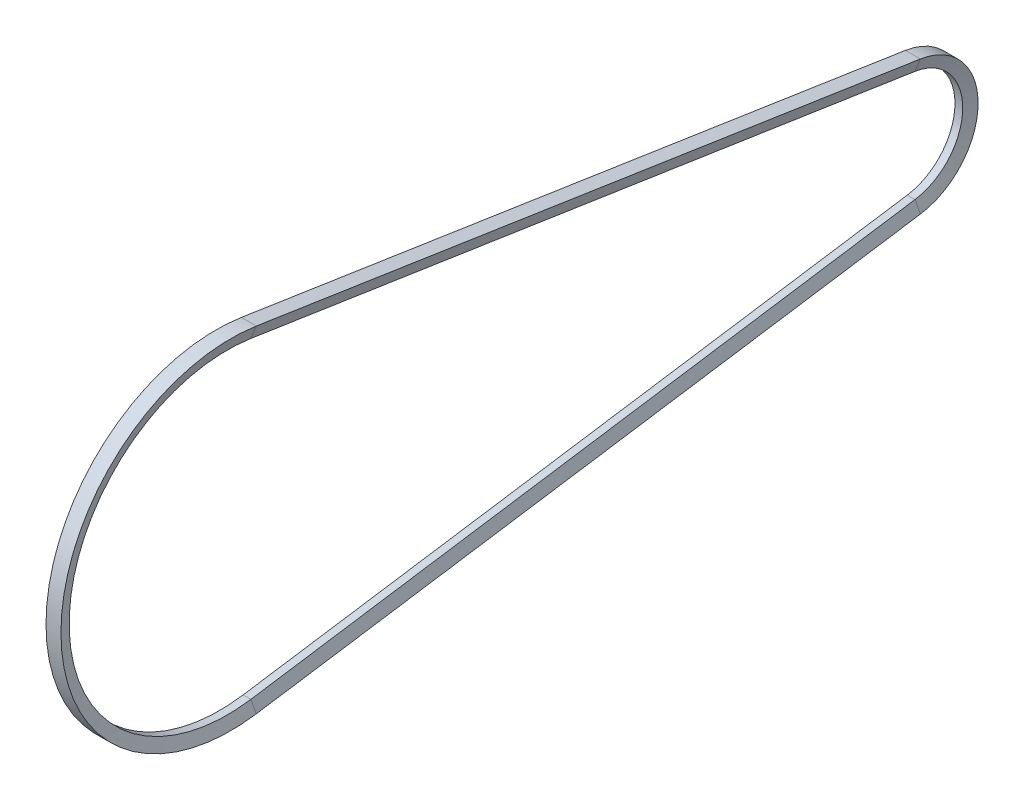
from build123d import *


with BuildPart() as part:
    # Sweep 1: sweep along a path in Sketch 1
    with BuildLine(Plane(origin=(0, 0, 0), x_dir=(0, 0, -1), z_dir=(1, 0, 0))) as sweep_1_path:
        Line((18.75, 123.585749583), (507.5, 49.434299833))
        ThreePointArc((507.5, 49.434299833), (550, 0), (507.5, -49.434299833))
        Line((507.5, -49.434299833), (18.75, -123.585749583))
        ThreePointArc((18.75, -123.585749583), (-125, 0), (18.75, 123.585749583))
    # Sketch 2 → Sweep 1 (sweep)
    with BuildSketch(Plane.XY):
        Polygon((-5.5, 125), (5.5, 125), (2.840143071, 116.3), (-2.840143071, 116.3), align=None)
    sweep(path=sweep_1_path.line)


solid = part.part
